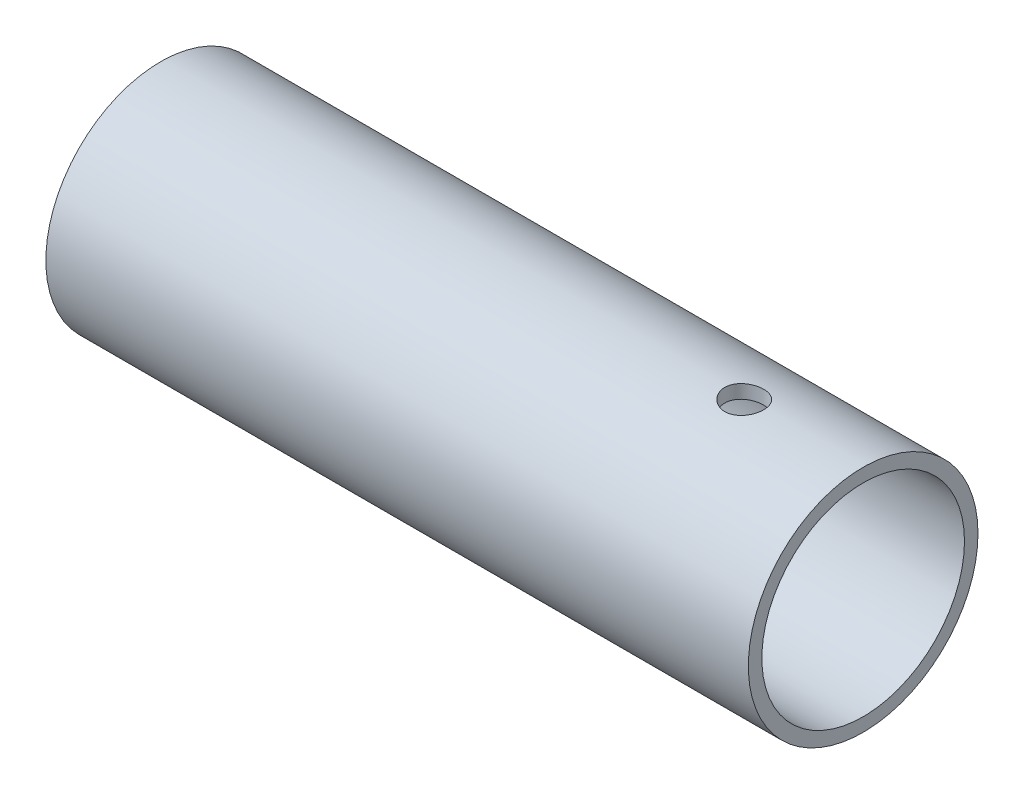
ISO-10303-21;
HEADER;
FILE_DESCRIPTION(('STEP AP214'),'2;1');
FILE_NAME('part.step','',(''),(''),'','','');
FILE_SCHEMA(('AUTOMOTIVE_DESIGN { 1 0 10303 214 1 1 1 1 }'));
ENDSEC;
DATA;
#1=APPLICATION_CONTEXT('core data for automotive mechanical design processes');
#2=APPLICATION_PROTOCOL_DEFINITION('international standard','automotive_design',2000,#1);
#3=PRODUCT_CONTEXT('',#1,'mechanical');
#4=PRODUCT('Part','Part','',(#3));
#5=PRODUCT_RELATED_PRODUCT_CATEGORY('part','',(#4));
#6=PRODUCT_DEFINITION_FORMATION('','',#4);
#7=PRODUCT_DEFINITION_CONTEXT('part definition',#1,'design');
#8=PRODUCT_DEFINITION('design','',#6,#7);
#9=PRODUCT_DEFINITION_SHAPE('','',#8);
#10=(LENGTH_UNIT() NAMED_UNIT(*) SI_UNIT(.MILLI.,.METRE.));
#11=(NAMED_UNIT(*) PLANE_ANGLE_UNIT() SI_UNIT($,.RADIAN.));
#12=(NAMED_UNIT(*) SI_UNIT($,.STERADIAN.) SOLID_ANGLE_UNIT());
#13=UNCERTAINTY_MEASURE_WITH_UNIT(LENGTH_MEASURE(1.E-05),#10,'distance_accuracy_value','');
#14=(GEOMETRIC_REPRESENTATION_CONTEXT(3) GLOBAL_UNCERTAINTY_ASSIGNED_CONTEXT((#13)) GLOBAL_UNIT_ASSIGNED_CONTEXT((#10,
#11,#12)) REPRESENTATION_CONTEXT('',''));
#15=CARTESIAN_POINT('',(0.,0.,0.));
#16=DIRECTION('',(0.,0.,1.));
#17=DIRECTION('',(1.,0.,0.));
#18=AXIS2_PLACEMENT_3D('',#15,#16,#17);
#19=CARTESIAN_POINT('',(330.2,0.,0.));
#20=DIRECTION('',(-1.,0.,0.));
#21=DIRECTION('',(0.,0.,1.));
#22=AXIS2_PLACEMENT_3D('',#19,#20,#21);
#23=CYLINDRICAL_SURFACE('',#22,53.975);
#24=CARTESIAN_POINT('',(55.88,-53.197537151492,9.12812499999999));
#25=CARTESIAN_POINT('',(56.1344780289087,-53.1975352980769,9.12812900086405));
#26=CARTESIAN_POINT('',(56.3889022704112,-53.19936669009,9.11748003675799));
#27=CARTESIAN_POINT('',(56.8959992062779,-53.2066348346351,9.07497278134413));
#28=CARTESIAN_POINT('',(57.1486715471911,-53.212072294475,9.04311032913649));
#29=CARTESIAN_POINT('',(57.650569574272,-53.2264020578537,8.95838065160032));
#30=CARTESIAN_POINT('',(57.8997923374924,-53.2352971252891,8.90549662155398));
#31=CARTESIAN_POINT('',(58.3928271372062,-53.2562822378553,8.77913017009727));
#32=CARTESIAN_POINT('',(58.636639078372,-53.2683723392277,8.70564738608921));
#33=CARTESIAN_POINT('',(59.1169230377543,-53.2953861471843,8.5387104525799));
#34=CARTESIAN_POINT('',(59.3534012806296,-53.3103073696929,8.44527380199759));
#35=CARTESIAN_POINT('',(59.8176081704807,-53.3425636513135,8.23907823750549));
#36=CARTESIAN_POINT('',(60.0453367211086,-53.3598987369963,8.12631911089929));
#37=CARTESIAN_POINT('',(60.4904189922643,-53.3964861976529,7.88232779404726));
#38=CARTESIAN_POINT('',(60.7077758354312,-53.4157379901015,7.75110121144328));
#39=CARTESIAN_POINT('',(61.1307954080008,-53.4556306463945,7.471023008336));
#40=CARTESIAN_POINT('',(61.3364539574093,-53.4762720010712,7.32216514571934));
#41=CARTESIAN_POINT('',(61.7363429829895,-53.5185465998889,7.00652266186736));
#42=CARTESIAN_POINT('',(61.9304587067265,-53.5401869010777,6.83959358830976));
#43=CARTESIAN_POINT('',(62.3040609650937,-53.5836922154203,6.48996090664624));
#44=CARTESIAN_POINT('',(62.4835408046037,-53.6055573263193,6.30725015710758));
#45=CARTESIAN_POINT('',(62.8265508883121,-53.6488916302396,5.92735973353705));
#46=CARTESIAN_POINT('',(62.9900801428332,-53.6703607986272,5.73017916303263));
#47=CARTESIAN_POINT('',(63.299968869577,-53.7122921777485,5.32279961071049));
#48=CARTESIAN_POINT('',(63.446336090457,-53.7327548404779,5.11260657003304));
#49=CARTESIAN_POINT('',(63.7218593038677,-53.7722418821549,4.67913390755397));
#50=CARTESIAN_POINT('',(63.8508954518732,-53.7912558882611,4.45577713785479));
#51=CARTESIAN_POINT('',(64.0896220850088,-53.8271485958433,3.9988970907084));
#52=CARTESIAN_POINT('',(64.1993199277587,-53.8440281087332,3.76537772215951));
#53=CARTESIAN_POINT('',(64.3986259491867,-53.8751821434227,3.2897085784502));
#54=CARTESIAN_POINT('',(64.4882312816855,-53.8894562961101,3.04755758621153));
#55=CARTESIAN_POINT('',(64.6466475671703,-53.9149881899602,2.55639182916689));
#56=CARTESIAN_POINT('',(64.7154587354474,-53.9262459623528,2.30737713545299));
#57=CARTESIAN_POINT('',(64.831199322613,-53.9453306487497,1.80667988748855));
#58=CARTESIAN_POINT('',(64.8783303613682,-53.9531891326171,1.55504513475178));
#59=CARTESIAN_POINT('',(64.9513009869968,-53.9654071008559,1.04862285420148));
#60=CARTESIAN_POINT('',(64.9771406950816,-53.9697666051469,0.793835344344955));
#61=CARTESIAN_POINT('',(65.0073251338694,-53.9748626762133,0.282969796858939));
#62=CARTESIAN_POINT('',(65.0116711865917,-53.9755994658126,0.0268918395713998));
#63=CARTESIAN_POINT('',(64.998837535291,-53.9734297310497,-0.484707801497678));
#64=CARTESIAN_POINT('',(64.9816579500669,-53.9705232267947,-0.740229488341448));
#65=CARTESIAN_POINT('',(64.9261989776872,-53.9611984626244,-1.24621457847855));
#66=CARTESIAN_POINT('',(64.8881408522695,-53.9548170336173,-1.49670295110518));
#67=CARTESIAN_POINT('',(64.7913506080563,-53.9387416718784,-1.99363942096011));
#68=CARTESIAN_POINT('',(64.7326109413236,-53.9290465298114,-2.24008600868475));
#69=CARTESIAN_POINT('',(64.5949155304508,-53.9066146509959,-2.72707391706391));
#70=CARTESIAN_POINT('',(64.515963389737,-53.8938784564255,-2.96761628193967));
#71=CARTESIAN_POINT('',(64.3384198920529,-53.8657140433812,-3.44118425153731));
#72=CARTESIAN_POINT('',(64.2398279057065,-53.8502857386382,-3.67420961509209));
#73=CARTESIAN_POINT('',(64.0232159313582,-53.8170830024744,-4.13221143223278));
#74=CARTESIAN_POINT('',(63.9051074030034,-53.7992979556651,-4.35714523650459));
#75=CARTESIAN_POINT('',(63.6506324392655,-53.7619275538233,-4.79628400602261));
#76=CARTESIAN_POINT('',(63.514265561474,-53.7423421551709,-5.01048871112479));
#77=CARTESIAN_POINT('',(63.2242225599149,-53.7019082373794,-5.42673111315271));
#78=CARTESIAN_POINT('',(63.0705454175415,-53.6810596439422,-5.62876809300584));
#79=CARTESIAN_POINT('',(62.7469447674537,-53.6386723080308,-6.01930615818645));
#80=CARTESIAN_POINT('',(62.577021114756,-53.6171335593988,-6.20780712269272));
#81=CARTESIAN_POINT('',(62.2198569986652,-53.5736870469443,-6.57227437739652));
#82=CARTESIAN_POINT('',(62.0324264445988,-53.5517780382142,-6.74805429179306));
#83=CARTESIAN_POINT('',(61.6433865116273,-53.5084780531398,-7.08321700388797));
#84=CARTESIAN_POINT('',(61.4417773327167,-53.4870870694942,-7.24260003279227));
#85=CARTESIAN_POINT('',(61.0257553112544,-53.4454294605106,-7.54386028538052));
#86=CARTESIAN_POINT('',(60.8113419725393,-53.4251628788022,-7.68573683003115));
#87=CARTESIAN_POINT('',(60.3712052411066,-53.3863357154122,-7.95095937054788));
#88=CARTESIAN_POINT('',(60.1454821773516,-53.3677750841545,-8.07430590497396));
#89=CARTESIAN_POINT('',(59.6839684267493,-53.3328709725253,-8.3017324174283));
#90=CARTESIAN_POINT('',(59.448164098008,-53.3165306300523,-8.40578520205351));
#91=CARTESIAN_POINT('',(58.9685411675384,-53.2865817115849,-8.59359534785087));
#92=CARTESIAN_POINT('',(58.7247256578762,-53.2729720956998,-8.67736043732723));
#93=CARTESIAN_POINT('',(58.230711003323,-53.2488772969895,-8.82401385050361));
#94=CARTESIAN_POINT('',(57.9805111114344,-53.2383924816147,-8.88689971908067));
#95=CARTESIAN_POINT('',(57.4755717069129,-53.2208619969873,-8.9912891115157));
#96=CARTESIAN_POINT('',(57.2208322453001,-53.2138162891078,-9.03279287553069));
#97=CARTESIAN_POINT('',(56.7118324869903,-53.203439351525,-9.09371263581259));
#98=CARTESIAN_POINT('',(56.4576048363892,-53.200063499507,-9.11339403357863));
#99=CARTESIAN_POINT('',(55.948372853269,-53.1969718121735,-9.13142377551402));
#100=CARTESIAN_POINT('',(55.6933685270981,-53.1972559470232,-9.12977229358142));
#101=CARTESIAN_POINT('',(55.1844319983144,-53.2014757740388,-9.10514992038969));
#102=CARTESIAN_POINT('',(54.9304997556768,-53.2054113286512,-9.08217983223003));
#103=CARTESIAN_POINT('',(54.4255241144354,-53.2168181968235,-9.01510070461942));
#104=CARTESIAN_POINT('',(54.1744807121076,-53.2242895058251,-8.97099169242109));
#105=CARTESIAN_POINT('',(53.6787532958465,-53.242487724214,-8.8623435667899));
#106=CARTESIAN_POINT('',(53.4340378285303,-53.2531923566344,-8.7979441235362));
#107=CARTESIAN_POINT('',(52.9508421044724,-53.2775719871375,-8.64908279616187));
#108=CARTESIAN_POINT('',(52.7123641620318,-53.2912480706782,-8.56461357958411));
#109=CARTESIAN_POINT('',(52.2434132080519,-53.3211774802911,-8.37626061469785));
#110=CARTESIAN_POINT('',(52.0129390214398,-53.3374304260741,-8.27237973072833));
#111=CARTESIAN_POINT('',(51.5615178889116,-53.3720581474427,-8.04593967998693));
#112=CARTESIAN_POINT('',(51.3405712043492,-53.390432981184,-7.92338000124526));
#113=CARTESIAN_POINT('',(50.9076543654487,-53.4289738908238,-7.65920055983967));
#114=CARTESIAN_POINT('',(50.6957889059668,-53.4491552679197,-7.51741145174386));
#115=CARTESIAN_POINT('',(50.2847149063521,-53.4905911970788,-7.21666897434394));
#116=CARTESIAN_POINT('',(50.0855068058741,-53.5118457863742,-7.05771500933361));
#117=CARTESIAN_POINT('',(49.7011334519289,-53.55483054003,-6.72376969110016));
#118=CARTESIAN_POINT('',(49.5159658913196,-53.5765606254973,-6.5487809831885));
#119=CARTESIAN_POINT('',(49.1608160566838,-53.6199058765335,-6.18385697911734));
#120=CARTESIAN_POINT('',(48.9908404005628,-53.6415209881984,-5.99391523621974));
#121=CARTESIAN_POINT('',(48.6655858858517,-53.6842570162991,-5.59831837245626));
#122=CARTESIAN_POINT('',(48.5104847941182,-53.7053701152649,-5.39251619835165));
#123=CARTESIAN_POINT('',(48.2182432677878,-53.7462514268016,-4.96854204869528));
#124=CARTESIAN_POINT('',(48.0810948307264,-53.7660202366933,-4.75037564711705));
#125=CARTESIAN_POINT('',(47.8256169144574,-53.8036715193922,-4.30301684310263));
#126=CARTESIAN_POINT('',(47.7072948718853,-53.8215532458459,-4.07382012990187));
#127=CARTESIAN_POINT('',(47.4904512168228,-53.8549069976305,-3.60618048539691));
#128=CARTESIAN_POINT('',(47.391922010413,-53.8703799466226,-3.36774114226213));
#129=CARTESIAN_POINT('',(47.2157315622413,-53.8984226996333,-2.88427271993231));
#130=CARTESIAN_POINT('',(47.137982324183,-53.9110047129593,-2.63927642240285));
#131=CARTESIAN_POINT('',(47.0033900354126,-53.9329931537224,-2.14346590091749));
#132=CARTESIAN_POINT('',(46.9465469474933,-53.9423995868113,-1.89265168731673));
#133=CARTESIAN_POINT('',(46.8542128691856,-53.9577679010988,-1.38703672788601));
#134=CARTESIAN_POINT('',(46.8187203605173,-53.9637300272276,-1.13223626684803));
#135=CARTESIAN_POINT('',(46.7693614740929,-53.9720399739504,-0.620491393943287));
#136=CARTESIAN_POINT('',(46.755494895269,-53.9743878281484,-0.363547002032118));
#137=CARTESIAN_POINT('',(46.7495345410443,-53.9753958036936,0.147389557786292));
#138=CARTESIAN_POINT('',(46.7571710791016,-53.9741016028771,0.40137853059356));
#139=CARTESIAN_POINT('',(46.793580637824,-53.9679595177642,0.907797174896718));
#140=CARTESIAN_POINT('',(46.8223539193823,-53.9631115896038,1.16022682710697));
#141=CARTESIAN_POINT('',(46.9008145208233,-53.9499975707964,1.66171777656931));
#142=CARTESIAN_POINT('',(46.9505014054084,-53.9417315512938,1.91077914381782));
#143=CARTESIAN_POINT('',(47.0704103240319,-53.9220116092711,2.40377893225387));
#144=CARTESIAN_POINT('',(47.1406324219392,-53.9105576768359,2.64771733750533));
#145=CARTESIAN_POINT('',(47.3009751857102,-53.8847972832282,3.12843615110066));
#146=CARTESIAN_POINT('',(47.3910685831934,-53.8704947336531,3.36522586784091));
#147=CARTESIAN_POINT('',(47.5905823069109,-53.8394158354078,3.83044402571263));
#148=CARTESIAN_POINT('',(47.7000092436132,-53.8226386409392,4.05886957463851));
#149=CARTESIAN_POINT('',(47.9373657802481,-53.7870768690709,4.50568691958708));
#150=CARTESIAN_POINT('',(48.0652926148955,-53.7682925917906,4.72408020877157));
#151=CARTESIAN_POINT('',(48.3387667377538,-53.7292271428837,5.14940706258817));
#152=CARTESIAN_POINT('',(48.4843146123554,-53.7089459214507,5.35634024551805));
#153=CARTESIAN_POINT('',(48.793839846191,-53.6671952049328,5.75972122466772));
#154=CARTESIAN_POINT('',(48.9580140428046,-53.6457145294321,5.95601685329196));
#155=CARTESIAN_POINT('',(49.3022346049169,-53.602386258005,6.33411648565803));
#156=CARTESIAN_POINT('',(49.4822810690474,-53.5805386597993,6.51592039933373));
#157=CARTESIAN_POINT('',(49.8570575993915,-53.5370820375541,6.86383431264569));
#158=CARTESIAN_POINT('',(50.0517912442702,-53.5154730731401,7.02994046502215));
#159=CARTESIAN_POINT('',(50.4545691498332,-53.4731068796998,7.34525552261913));
#160=CARTESIAN_POINT('',(50.6626131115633,-53.452349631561,7.49446480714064));
#161=CARTESIAN_POINT('',(51.0922082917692,-53.4121226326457,7.77599913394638));
#162=CARTESIAN_POINT('',(51.3138493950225,-53.3926637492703,7.90818863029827));
#163=CARTESIAN_POINT('',(51.7675728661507,-53.3557767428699,8.15334779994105));
#164=CARTESIAN_POINT('',(51.9996513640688,-53.338347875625,8.26632452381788));
#165=CARTESIAN_POINT('',(52.4725351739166,-53.3060334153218,8.47220704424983));
#166=CARTESIAN_POINT('',(52.713334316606,-53.2911460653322,8.56512671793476));
#167=CARTESIAN_POINT('',(53.2020049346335,-53.2643413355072,8.73026587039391));
#168=CARTESIAN_POINT('',(53.4498748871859,-53.2524233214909,8.80248976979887));
#169=CARTESIAN_POINT('',(54.056415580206,-53.227598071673,8.95161754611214));
#170=CARTESIAN_POINT('',(54.4178662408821,-53.2163806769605,9.01772824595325));
#171=CARTESIAN_POINT('',(55.1462485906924,-53.2013516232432,9.10597867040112));
#172=CARTESIAN_POINT('',(55.5131801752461,-53.1975398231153,9.12811923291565));
#173=CARTESIAN_POINT('',(55.88,-53.197537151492,9.12812499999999));
#174=B_SPLINE_CURVE_WITH_KNOTS('',3,(#24,#25,#26,#27,#28,#29,#30,#31,#32,#33,#34,#35,#36,#37,
#38,#39,#40,#41,#42,#43,#44,#45,#46,#47,#48,#49,#50,#51,#52,#53,#54,#55,#56,#57,#58,#59,#60,#61,
#62,#63,#64,#65,#66,#67,#68,#69,#70,#71,#72,#73,#74,#75,#76,#77,#78,#79,#80,#81,#82,#83,#84,#85,
#86,#87,#88,#89,#90,#91,#92,#93,#94,#95,#96,#97,#98,#99,#100,#101,#102,#103,#104,#105,#106,#107,
#108,#109,#110,#111,#112,#113,#114,#115,#116,#117,#118,#119,#120,#121,#122,#123,#124,#125,#126,
#127,#128,#129,#130,#131,#132,#133,#134,#135,#136,#137,#138,#139,#140,#141,#142,#143,#144,#145,
#146,#147,#148,#149,#150,#151,#152,#153,#154,#155,#156,#157,#158,#159,#160,#161,#162,#163,#164,
#165,#166,#167,#168,#169,#170,#171,#172,#173),.UNSPECIFIED.,.T.,.F.,(4,2,2,2,2,2,2,2,2,2,2,2,2,
2,2,2,2,2,2,2,2,2,2,2,2,2,2,2,2,2,2,2,2,2,2,2,2,2,2,2,2,2,2,2,2,2,2,2,2,2,2,2,2,2,2,2,2,2,2,2,2,
2,2,2,2,2,2,2,2,2,2,2,2,2,4),(0.,0.763112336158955,1.52637439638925,2.29024784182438,
3.05413473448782,3.81735445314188,4.58058257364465,5.34357943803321,6.10684724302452,
6.87674336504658,7.64698971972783,8.41728383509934,9.18722881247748,9.96225038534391,
10.7369764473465,11.5118121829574,12.2866398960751,13.0541084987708,13.8215727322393,
14.5889897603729,15.3564025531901,16.1158354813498,16.8755458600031,17.6351208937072,
18.3947202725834,19.1578654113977,19.9210290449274,20.6842376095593,21.4474529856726,
22.2202191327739,22.9929743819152,23.7657595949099,24.5385223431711,25.3123661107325,
26.0859146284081,26.8595540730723,27.6331848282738,28.3972998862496,29.161408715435,
29.9254887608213,30.6895678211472,31.4484981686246,32.2077062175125,32.9668023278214,
33.725919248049,34.4922176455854,35.2585426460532,36.0247414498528,36.7912724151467,
37.5660491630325,38.3404793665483,39.1152147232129,39.8896522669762,40.660756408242,
41.4318591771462,42.2029071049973,42.9739478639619,43.7353616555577,44.496784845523,
45.258192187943,46.0196018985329,46.7799731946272,47.5406049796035,48.3011231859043,
49.0616667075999,49.8311661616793,50.6006703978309,51.3703627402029,52.1400378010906,
52.9155063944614,53.6906897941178,54.46533512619,55.2398148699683,56.3398315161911,
57.4398271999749),.UNSPECIFIED.);
#175=CARTESIAN_POINT('',(55.88,-53.197537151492,9.12812499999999));
#176=VERTEX_POINT('',#175);
#177=EDGE_CURVE('E72',#176,#176,#174,.T.);
#178=ORIENTED_EDGE('',*,*,#177,.T.);
#179=EDGE_LOOP('',(#178));
#180=FACE_BOUND('',#179,.T.);
#181=CARTESIAN_POINT('',(330.2,0.,0.));
#182=DIRECTION('',(1.,0.,0.));
#183=DIRECTION('',(0.,0.,-1.));
#184=AXIS2_PLACEMENT_3D('',#181,#182,#183);
#185=CIRCLE('',#184,53.975);
#186=CARTESIAN_POINT('',(330.2,0.,-53.975));
#187=VERTEX_POINT('',#186);
#188=EDGE_CURVE('E10',#187,#187,#185,.T.);
#189=ORIENTED_EDGE('',*,*,#188,.F.);
#190=EDGE_LOOP('',(#189));
#191=FACE_BOUND('',#190,.T.);
#192=CARTESIAN_POINT('',(0.,0.,0.));
#193=DIRECTION('',(1.,0.,0.));
#194=DIRECTION('',(0.,0.,-1.));
#195=AXIS2_PLACEMENT_3D('',#192,#193,#194);
#196=CIRCLE('',#195,53.975);
#197=CARTESIAN_POINT('',(0.,0.,-53.975));
#198=VERTEX_POINT('',#197);
#199=EDGE_CURVE('E54',#198,#198,#196,.T.);
#200=ORIENTED_EDGE('',*,*,#199,.T.);
#201=EDGE_LOOP('',(#200));
#202=FACE_BOUND('',#201,.T.);
#203=CARTESIAN_POINT('',(274.32,53.197537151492,-9.12812500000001));
#204=CARTESIAN_POINT('',(274.065521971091,53.1975352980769,-9.12812900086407));
#205=CARTESIAN_POINT('',(273.811097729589,53.19936669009,-9.11748003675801));
#206=CARTESIAN_POINT('',(273.304000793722,53.206634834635,-9.07497278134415));
#207=CARTESIAN_POINT('',(273.051328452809,53.212072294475,-9.04311032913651));
#208=CARTESIAN_POINT('',(272.549430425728,53.2264020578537,-8.95838065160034));
#209=CARTESIAN_POINT('',(272.300207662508,53.2352971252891,-8.905496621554));
#210=CARTESIAN_POINT('',(271.807172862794,53.2562822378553,-8.77913017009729));
#211=CARTESIAN_POINT('',(271.563360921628,53.2683723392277,-8.70564738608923));
#212=CARTESIAN_POINT('',(271.083076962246,53.2953861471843,-8.53871045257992));
#213=CARTESIAN_POINT('',(270.84659871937,53.3103073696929,-8.4452738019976));
#214=CARTESIAN_POINT('',(270.382391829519,53.3425636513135,-8.23907823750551));
#215=CARTESIAN_POINT('',(270.154663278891,53.3598987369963,-8.12631911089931));
#216=CARTESIAN_POINT('',(269.709581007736,53.3964861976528,-7.88232779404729));
#217=CARTESIAN_POINT('',(269.492224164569,53.4157379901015,-7.7511012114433));
#218=CARTESIAN_POINT('',(269.069204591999,53.4556306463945,-7.47102300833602));
#219=CARTESIAN_POINT('',(268.863546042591,53.4762720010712,-7.32216514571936));
#220=CARTESIAN_POINT('',(268.463657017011,53.5185465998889,-7.00652266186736));
#221=CARTESIAN_POINT('',(268.269541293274,53.5401869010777,-6.83959358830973));
#222=CARTESIAN_POINT('',(267.895939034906,53.5836922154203,-6.4899609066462));
#223=CARTESIAN_POINT('',(267.716459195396,53.6055573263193,-6.30725015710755));
#224=CARTESIAN_POINT('',(267.373449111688,53.6488916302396,-5.92735973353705));
#225=CARTESIAN_POINT('',(267.209919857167,53.6703607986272,-5.73017916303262));
#226=CARTESIAN_POINT('',(266.900031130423,53.7122921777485,-5.32279961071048));
#227=CARTESIAN_POINT('',(266.753663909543,53.7327548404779,-5.11260657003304));
#228=CARTESIAN_POINT('',(266.478140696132,53.7722418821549,-4.67913390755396));
#229=CARTESIAN_POINT('',(266.349104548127,53.7912558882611,-4.45577713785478));
#230=CARTESIAN_POINT('',(266.110377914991,53.8271485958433,-3.99889709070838));
#231=CARTESIAN_POINT('',(266.000680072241,53.8440281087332,-3.76537772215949));
#232=CARTESIAN_POINT('',(265.801374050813,53.8751821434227,-3.28970857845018));
#233=CARTESIAN_POINT('',(265.711768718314,53.8894562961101,-3.04755758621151));
#234=CARTESIAN_POINT('',(265.55335243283,53.9149881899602,-2.55639182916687));
#235=CARTESIAN_POINT('',(265.484541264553,53.9262459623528,-2.30737713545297));
#236=CARTESIAN_POINT('',(265.368800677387,53.9453306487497,-1.80667988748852));
#237=CARTESIAN_POINT('',(265.321669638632,53.9531891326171,-1.55504513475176));
#238=CARTESIAN_POINT('',(265.248699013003,53.9654071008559,-1.04862285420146));
#239=CARTESIAN_POINT('',(265.222859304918,53.9697666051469,-0.79383534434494));
#240=CARTESIAN_POINT('',(265.192674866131,53.9748626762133,-0.282969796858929));
#241=CARTESIAN_POINT('',(265.188328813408,53.9755994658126,-0.0268918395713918));
#242=CARTESIAN_POINT('',(265.201162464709,53.9734297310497,0.484707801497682));
#243=CARTESIAN_POINT('',(265.218342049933,53.9705232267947,0.74022948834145));
#244=CARTESIAN_POINT('',(265.273801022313,53.9611984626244,1.24621457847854));
#245=CARTESIAN_POINT('',(265.311859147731,53.9548170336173,1.49670295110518));
#246=CARTESIAN_POINT('',(265.408649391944,53.9387416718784,1.9936394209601));
#247=CARTESIAN_POINT('',(265.467389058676,53.9290465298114,2.24008600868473));
#248=CARTESIAN_POINT('',(265.605084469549,53.9066146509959,2.72707391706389));
#249=CARTESIAN_POINT('',(265.684036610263,53.8938784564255,2.96761628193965));
#250=CARTESIAN_POINT('',(265.861580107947,53.8657140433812,3.4411842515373));
#251=CARTESIAN_POINT('',(265.960172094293,53.8502857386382,3.67420961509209));
#252=CARTESIAN_POINT('',(266.176784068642,53.8170830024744,4.13221143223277));
#253=CARTESIAN_POINT('',(266.294892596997,53.7992979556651,4.35714523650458));
#254=CARTESIAN_POINT('',(266.549367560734,53.7619275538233,4.7962840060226));
#255=CARTESIAN_POINT('',(266.685734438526,53.7423421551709,5.01048871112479));
#256=CARTESIAN_POINT('',(266.975777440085,53.7019082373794,5.42673111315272));
#257=CARTESIAN_POINT('',(267.129454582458,53.6810596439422,5.62876809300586));
#258=CARTESIAN_POINT('',(267.453055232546,53.6386723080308,6.01930615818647));
#259=CARTESIAN_POINT('',(267.622978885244,53.6171335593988,6.20780712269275));
#260=CARTESIAN_POINT('',(267.980143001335,53.5736870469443,6.57227437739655));
#261=CARTESIAN_POINT('',(268.167573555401,53.5517780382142,6.74805429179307));
#262=CARTESIAN_POINT('',(268.556613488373,53.5084780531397,7.08321700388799));
#263=CARTESIAN_POINT('',(268.758222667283,53.4870870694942,7.2426000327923));
#264=CARTESIAN_POINT('',(269.174244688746,53.4454294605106,7.54386028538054));
#265=CARTESIAN_POINT('',(269.388658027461,53.4251628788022,7.68573683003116));
#266=CARTESIAN_POINT('',(269.828794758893,53.3863357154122,7.95095937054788));
#267=CARTESIAN_POINT('',(270.054517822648,53.3677750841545,8.07430590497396));
#268=CARTESIAN_POINT('',(270.516031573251,53.3328709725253,8.3017324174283));
#269=CARTESIAN_POINT('',(270.751835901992,53.3165306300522,8.40578520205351));
#270=CARTESIAN_POINT('',(271.231458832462,53.2865817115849,8.59359534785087));
#271=CARTESIAN_POINT('',(271.475274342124,53.2729720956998,8.67736043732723));
#272=CARTESIAN_POINT('',(271.969288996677,53.2488772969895,8.82401385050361));
#273=CARTESIAN_POINT('',(272.219488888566,53.2383924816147,8.88689971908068));
#274=CARTESIAN_POINT('',(272.724428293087,53.2208619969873,8.99128911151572));
#275=CARTESIAN_POINT('',(272.9791677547,53.2138162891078,9.03279287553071));
#276=CARTESIAN_POINT('',(273.48816751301,53.203439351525,9.09371263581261));
#277=CARTESIAN_POINT('',(273.742395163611,53.200063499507,9.11339403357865));
#278=CARTESIAN_POINT('',(274.251627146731,53.1969718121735,9.13142377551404));
#279=CARTESIAN_POINT('',(274.506631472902,53.1972559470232,9.12977229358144));
#280=CARTESIAN_POINT('',(275.015568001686,53.2014757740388,9.10514992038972));
#281=CARTESIAN_POINT('',(275.269500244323,53.2054113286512,9.08217983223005));
#282=CARTESIAN_POINT('',(275.774475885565,53.2168181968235,9.01510070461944));
#283=CARTESIAN_POINT('',(276.025519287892,53.2242895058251,8.9709916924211));
#284=CARTESIAN_POINT('',(276.521246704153,53.242487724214,8.86234356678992));
#285=CARTESIAN_POINT('',(276.76596217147,53.2531923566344,8.79794412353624));
#286=CARTESIAN_POINT('',(277.249157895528,53.2775719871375,8.64908279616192));
#287=CARTESIAN_POINT('',(277.487635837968,53.2912480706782,8.56461357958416));
#288=CARTESIAN_POINT('',(277.956586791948,53.3211774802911,8.3762606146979));
#289=CARTESIAN_POINT('',(278.18706097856,53.3374304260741,8.27237973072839));
#290=CARTESIAN_POINT('',(278.638482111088,53.3720581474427,8.04593967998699));
#291=CARTESIAN_POINT('',(278.859428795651,53.390432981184,7.92338000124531));
#292=CARTESIAN_POINT('',(279.292345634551,53.4289738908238,7.65920055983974));
#293=CARTESIAN_POINT('',(279.504211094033,53.4491552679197,7.51741145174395));
#294=CARTESIAN_POINT('',(279.915285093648,53.4905911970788,7.21666897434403));
#295=CARTESIAN_POINT('',(280.114493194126,53.5118457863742,7.05771500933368));
#296=CARTESIAN_POINT('',(280.498866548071,53.55483054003,6.72376969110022));
#297=CARTESIAN_POINT('',(280.68403410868,53.5765606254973,6.54878098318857));
#298=CARTESIAN_POINT('',(281.039183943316,53.6199058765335,6.1838569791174));
#299=CARTESIAN_POINT('',(281.209159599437,53.6415209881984,5.99391523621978));
#300=CARTESIAN_POINT('',(281.534414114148,53.6842570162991,5.59831837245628));
#301=CARTESIAN_POINT('',(281.689515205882,53.7053701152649,5.39251619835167));
#302=CARTESIAN_POINT('',(281.981756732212,53.7462514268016,4.9685420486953));
#303=CARTESIAN_POINT('',(282.118905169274,53.7660202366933,4.75037564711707));
#304=CARTESIAN_POINT('',(282.374383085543,53.8036715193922,4.30301684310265));
#305=CARTESIAN_POINT('',(282.492705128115,53.8215532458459,4.07382012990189));
#306=CARTESIAN_POINT('',(282.709548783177,53.8549069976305,3.60618048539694));
#307=CARTESIAN_POINT('',(282.808077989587,53.8703799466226,3.36774114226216));
#308=CARTESIAN_POINT('',(282.984268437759,53.8984226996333,2.88427271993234));
#309=CARTESIAN_POINT('',(283.062017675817,53.9110047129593,2.63927642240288));
#310=CARTESIAN_POINT('',(283.196609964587,53.9329931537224,2.14346590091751));
#311=CARTESIAN_POINT('',(283.253453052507,53.9423995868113,1.89265168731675));
#312=CARTESIAN_POINT('',(283.345787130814,53.9577679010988,1.38703672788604));
#313=CARTESIAN_POINT('',(283.381279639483,53.9637300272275,1.13223626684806));
#314=CARTESIAN_POINT('',(283.430638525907,53.9720399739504,0.620491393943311));
#315=CARTESIAN_POINT('',(283.444505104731,53.9743878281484,0.363547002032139));
#316=CARTESIAN_POINT('',(283.450465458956,53.9753958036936,-0.147389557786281));
#317=CARTESIAN_POINT('',(283.442828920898,53.9741016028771,-0.401378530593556));
#318=CARTESIAN_POINT('',(283.406419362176,53.9679595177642,-0.907797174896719));
#319=CARTESIAN_POINT('',(283.377646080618,53.9631115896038,-1.16022682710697));
#320=CARTESIAN_POINT('',(283.299185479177,53.9499975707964,-1.66171777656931));
#321=CARTESIAN_POINT('',(283.249498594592,53.9417315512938,-1.91077914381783));
#322=CARTESIAN_POINT('',(283.129589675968,53.9220116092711,-2.40377893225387));
#323=CARTESIAN_POINT('',(283.059367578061,53.9105576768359,-2.64771733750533));
#324=CARTESIAN_POINT('',(282.89902481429,53.8847972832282,-3.12843615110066));
#325=CARTESIAN_POINT('',(282.808931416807,53.8704947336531,-3.36522586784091));
#326=CARTESIAN_POINT('',(282.609417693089,53.8394158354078,-3.83044402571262));
#327=CARTESIAN_POINT('',(282.499990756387,53.8226386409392,-4.0588695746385));
#328=CARTESIAN_POINT('',(282.262634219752,53.7870768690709,-4.50568691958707));
#329=CARTESIAN_POINT('',(282.134707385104,53.7682925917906,-4.72408020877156));
#330=CARTESIAN_POINT('',(281.861233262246,53.7292271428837,-5.14940706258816));
#331=CARTESIAN_POINT('',(281.715685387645,53.7089459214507,-5.35634024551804));
#332=CARTESIAN_POINT('',(281.406160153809,53.6671952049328,-5.75972122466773));
#333=CARTESIAN_POINT('',(281.241985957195,53.6457145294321,-5.95601685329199));
#334=CARTESIAN_POINT('',(280.897765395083,53.602386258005,-6.33411648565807));
#335=CARTESIAN_POINT('',(280.717718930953,53.5805386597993,-6.51592039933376));
#336=CARTESIAN_POINT('',(280.342942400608,53.5370820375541,-6.86383431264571));
#337=CARTESIAN_POINT('',(280.14820875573,53.5154730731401,-7.02994046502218));
#338=CARTESIAN_POINT('',(279.745430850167,53.4731068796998,-7.34525552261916));
#339=CARTESIAN_POINT('',(279.537386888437,53.452349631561,-7.49446480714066));
#340=CARTESIAN_POINT('',(279.107791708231,53.4121226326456,-7.77599913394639));
#341=CARTESIAN_POINT('',(278.886150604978,53.3926637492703,-7.90818863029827));
#342=CARTESIAN_POINT('',(278.432427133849,53.3557767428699,-8.15334779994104));
#343=CARTESIAN_POINT('',(278.200348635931,53.338347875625,-8.26632452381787));
#344=CARTESIAN_POINT('',(277.727464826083,53.3060334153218,-8.47220704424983));
#345=CARTESIAN_POINT('',(277.486665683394,53.2911460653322,-8.56512671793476));
#346=CARTESIAN_POINT('',(276.997995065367,53.2643413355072,-8.73026587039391));
#347=CARTESIAN_POINT('',(276.750125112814,53.2524233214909,-8.80248976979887));
#348=CARTESIAN_POINT('',(276.143584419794,53.227598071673,-8.95161754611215));
#349=CARTESIAN_POINT('',(275.782133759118,53.2163806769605,-9.01772824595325));
#350=CARTESIAN_POINT('',(275.053751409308,53.2013516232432,-9.10597867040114));
#351=CARTESIAN_POINT('',(274.686819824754,53.1975398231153,-9.12811923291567));
#352=CARTESIAN_POINT('',(274.32,53.197537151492,-9.12812500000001));
#353=B_SPLINE_CURVE_WITH_KNOTS('',3,(#203,#204,#205,#206,#207,#208,#209,#210,#211,#212,#213,
#214,#215,#216,#217,#218,#219,#220,#221,#222,#223,#224,#225,#226,#227,#228,#229,#230,#231,#232,
#233,#234,#235,#236,#237,#238,#239,#240,#241,#242,#243,#244,#245,#246,#247,#248,#249,#250,#251,
#252,#253,#254,#255,#256,#257,#258,#259,#260,#261,#262,#263,#264,#265,#266,#267,#268,#269,#270,
#271,#272,#273,#274,#275,#276,#277,#278,#279,#280,#281,#282,#283,#284,#285,#286,#287,#288,#289,
#290,#291,#292,#293,#294,#295,#296,#297,#298,#299,#300,#301,#302,#303,#304,#305,#306,#307,#308,
#309,#310,#311,#312,#313,#314,#315,#316,#317,#318,#319,#320,#321,#322,#323,#324,#325,#326,#327,
#328,#329,#330,#331,#332,#333,#334,#335,#336,#337,#338,#339,#340,#341,#342,#343,#344,#345,#346,
#347,#348,#349,#350,#351,#352),.UNSPECIFIED.,.T.,.F.,(4,2,2,2,2,2,2,2,2,2,2,2,2,2,2,2,2,2,2,2,2,
2,2,2,2,2,2,2,2,2,2,2,2,2,2,2,2,2,2,2,2,2,2,2,2,2,2,2,2,2,2,2,2,2,2,2,2,2,2,2,2,2,2,2,2,2,2,2,2,
2,2,2,2,2,4),(0.,0.76311233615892,1.52637439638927,2.29024784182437,3.05413473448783,
3.8173544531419,4.58058257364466,5.34357943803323,6.10684724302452,6.87674336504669,
7.6469897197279,8.4172838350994,9.18722881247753,9.96225038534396,10.7369764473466,
11.5118121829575,12.2866398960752,13.0541084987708,13.8215727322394,14.588989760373,
15.3564025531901,16.1158354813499,16.8755458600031,17.6351208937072,18.3947202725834,
19.1578654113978,19.9210290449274,20.6842376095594,21.4474529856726,22.220219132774,
22.9929743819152,23.7657595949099,24.5385223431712,25.3123661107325,26.0859146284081,
26.8595540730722,27.6331848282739,28.3972998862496,29.161408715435,29.9254887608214,
30.6895678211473,31.4484981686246,32.2077062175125,32.9668023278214,33.725919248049,
34.4922176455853,35.2585426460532,36.0247414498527,36.7912724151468,37.5660491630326,
38.3404793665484,39.1152147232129,39.8896522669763,40.6607564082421,41.4318591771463,
42.2029071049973,42.973947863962,43.7353616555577,44.4967848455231,45.2581921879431,
46.019601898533,46.7799731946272,47.5406049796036,48.3011231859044,49.0616667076,
49.8311661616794,50.600670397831,51.3703627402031,52.1400378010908,52.9155063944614,
53.6906897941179,54.46533512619,55.2398148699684,56.3398315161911,57.439827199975),.UNSPECIFIED.);
#354=CARTESIAN_POINT('',(274.32,53.197537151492,-9.12812500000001));
#355=VERTEX_POINT('',#354);
#356=EDGE_CURVE('E73',#355,#355,#353,.T.);
#357=ORIENTED_EDGE('',*,*,#356,.F.);
#358=EDGE_LOOP('',(#357));
#359=FACE_BOUND('',#358,.T.);
#360=ADVANCED_FACE('F40',(#180,#191,#202,#359),#23,.T.);
#361=CARTESIAN_POINT('',(330.2,0.,0.));
#362=DIRECTION('',(-1.,0.,0.));
#363=DIRECTION('',(0.,0.,1.));
#364=AXIS2_PLACEMENT_3D('',#361,#362,#363);
#365=CYLINDRICAL_SURFACE('',#364,47.625);
#366=CARTESIAN_POINT('',(0.,0.,0.));
#367=DIRECTION('',(1.,0.,0.));
#368=DIRECTION('',(0.,0.,-1.));
#369=AXIS2_PLACEMENT_3D('',#366,#367,#368);
#370=CIRCLE('',#369,47.625);
#371=CARTESIAN_POINT('',(0.,0.,-47.625));
#372=VERTEX_POINT('',#371);
#373=EDGE_CURVE('E63',#372,#372,#370,.T.);
#374=ORIENTED_EDGE('',*,*,#373,.F.);
#375=EDGE_LOOP('',(#374));
#376=FACE_BOUND('',#375,.T.);
#377=CARTESIAN_POINT('',(330.2,0.,0.));
#378=DIRECTION('',(1.,0.,0.));
#379=DIRECTION('',(0.,0.,-1.));
#380=AXIS2_PLACEMENT_3D('',#377,#378,#379);
#381=CIRCLE('',#380,47.625);
#382=CARTESIAN_POINT('',(330.2,0.,-47.625));
#383=VERTEX_POINT('',#382);
#384=EDGE_CURVE('E60',#383,#383,#381,.T.);
#385=ORIENTED_EDGE('',*,*,#384,.T.);
#386=EDGE_LOOP('',(#385));
#387=FACE_BOUND('',#386,.T.);
#388=CARTESIAN_POINT('',(55.88,-46.7420363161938,9.12812499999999));
#389=CARTESIAN_POINT('',(56.1339119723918,-46.7420338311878,9.12812975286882));
#390=CARTESIAN_POINT('',(56.3877633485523,-46.7441091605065,9.11752769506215));
#391=CARTESIAN_POINT('',(56.8937102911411,-46.7523438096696,9.07521212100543));
#392=CARTESIAN_POINT('',(57.1458055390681,-46.7585038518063,9.0434948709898));
#393=CARTESIAN_POINT('',(57.6465261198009,-46.7747355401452,8.959161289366));
#394=CARTESIAN_POINT('',(57.8951488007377,-46.7848100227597,8.9065298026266));
#395=CARTESIAN_POINT('',(58.3869866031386,-46.8085740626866,8.78078077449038));
#396=CARTESIAN_POINT('',(58.6302016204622,-46.8222636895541,8.70766283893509));
#397=CARTESIAN_POINT('',(59.1092793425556,-46.8528452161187,8.54158269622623));
#398=CARTESIAN_POINT('',(59.3451490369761,-46.8697339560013,8.44864005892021));
#399=CARTESIAN_POINT('',(59.8081707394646,-46.9062385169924,8.24355832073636));
#400=CARTESIAN_POINT('',(60.0353226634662,-46.9258543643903,8.13141903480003));
#401=CARTESIAN_POINT('',(60.4793140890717,-46.9672524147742,7.88878693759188));
#402=CARTESIAN_POINT('',(60.6961563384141,-46.989034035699,7.75829905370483));
#403=CARTESIAN_POINT('',(61.1182253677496,-47.0341675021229,7.47981344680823));
#404=CARTESIAN_POINT('',(61.3234479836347,-47.0575199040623,7.33180950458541));
#405=CARTESIAN_POINT('',(61.7230775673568,-47.1054106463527,7.01758118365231));
#406=CARTESIAN_POINT('',(61.9173368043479,-47.1299593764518,6.85117047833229));
#407=CARTESIAN_POINT('',(62.2912790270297,-47.1793183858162,6.50257910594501));
#408=CARTESIAN_POINT('',(62.4709553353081,-47.2041287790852,6.32039129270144));
#409=CARTESIAN_POINT('',(62.8144238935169,-47.25330988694,5.94153273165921));
#410=CARTESIAN_POINT('',(62.9782150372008,-47.2776805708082,5.74486097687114));
#411=CARTESIAN_POINT('',(63.2886972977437,-47.3252915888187,5.33846697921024));
#412=CARTESIAN_POINT('',(63.4353961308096,-47.3485324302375,5.1287506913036));
#413=CARTESIAN_POINT('',(63.7119071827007,-47.3934378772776,4.69578825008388));
#414=CARTESIAN_POINT('',(63.8415667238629,-47.4150875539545,4.47244299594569));
#415=CARTESIAN_POINT('',(64.0815323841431,-47.4559702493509,4.01548321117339));
#416=CARTESIAN_POINT('',(64.1918459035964,-47.4752041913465,3.78187265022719));
#417=CARTESIAN_POINT('',(64.3923594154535,-47.5107196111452,3.30591822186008));
#418=CARTESIAN_POINT('',(64.4825568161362,-47.5270007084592,3.06357323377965));
#419=CARTESIAN_POINT('',(64.642116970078,-47.5561404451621,2.57191861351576));
#420=CARTESIAN_POINT('',(64.7114800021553,-47.5689991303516,2.32260907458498));
#421=CARTESIAN_POINT('',(64.828107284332,-47.5907904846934,1.82189931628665));
#422=CARTESIAN_POINT('',(64.8756293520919,-47.5997688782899,1.57056112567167));
#423=CARTESIAN_POINT('',(64.9494251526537,-47.6137702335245,1.06467506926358));
#424=CARTESIAN_POINT('',(64.9756990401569,-47.6187932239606,0.810127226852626));
#425=CARTESIAN_POINT('',(65.0067858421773,-47.6247408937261,0.299696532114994));
#426=CARTESIAN_POINT('',(65.0116004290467,-47.6256658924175,0.0438137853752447));
#427=CARTESIAN_POINT('',(64.9997340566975,-47.623392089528,-0.467433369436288));
#428=CARTESIAN_POINT('',(64.9830532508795,-47.620193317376,-0.722797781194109));
#429=CARTESIAN_POINT('',(64.9286957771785,-47.6098325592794,-1.22776182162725));
#430=CARTESIAN_POINT('',(64.8913010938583,-47.6027238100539,-1.47739296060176));
#431=CARTESIAN_POINT('',(64.795990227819,-47.5847733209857,-1.97266355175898));
#432=CARTESIAN_POINT('',(64.7380665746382,-47.5739302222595,-2.21830151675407));
#433=CARTESIAN_POINT('',(64.6021561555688,-47.5488118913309,-2.70373391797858));
#434=CARTESIAN_POINT('',(64.524172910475,-47.5345372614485,-2.94352937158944));
#435=CARTESIAN_POINT('',(64.3487198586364,-47.5029444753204,-3.41568167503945));
#436=CARTESIAN_POINT('',(64.251249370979,-47.4856262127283,-3.64803826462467));
#437=CARTESIAN_POINT('',(64.0369115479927,-47.4483083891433,-4.10506194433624));
#438=CARTESIAN_POINT('',(63.9199345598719,-47.4282938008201,-4.32967637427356));
#439=CARTESIAN_POINT('',(63.6678239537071,-47.3862081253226,-4.76827529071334));
#440=CARTESIAN_POINT('',(63.5326898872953,-47.3641369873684,-4.98225951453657));
#441=CARTESIAN_POINT('',(63.2451995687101,-47.3185374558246,-5.39818654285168));
#442=CARTESIAN_POINT('',(63.09284197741,-47.2950089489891,-5.60012840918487));
#443=CARTESIAN_POINT('',(62.7719514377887,-47.2471352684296,-5.99062078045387));
#444=CARTESIAN_POINT('',(62.6034183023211,-47.2227900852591,-6.17917113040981));
#445=CARTESIAN_POINT('',(62.2484775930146,-47.1735528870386,-6.54454461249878));
#446=CARTESIAN_POINT('',(62.0618266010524,-47.1486583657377,-6.7211310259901));
#447=CARTESIAN_POINT('',(61.6742691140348,-47.099411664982,-7.05797618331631));
#448=CARTESIAN_POINT('',(61.4733627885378,-47.0750594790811,-7.21823512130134));
#449=CARTESIAN_POINT('',(61.0586494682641,-47.0275870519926,-7.52131765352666));
#450=CARTESIAN_POINT('',(60.844841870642,-47.0044668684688,-7.66414043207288));
#451=CARTESIAN_POINT('',(60.4058032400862,-46.9601231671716,-7.93131786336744));
#452=CARTESIAN_POINT('',(60.1805725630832,-46.9388995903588,-8.05567309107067));
#453=CARTESIAN_POINT('',(59.7197619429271,-46.898922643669,-8.28524544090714));
#454=CARTESIAN_POINT('',(59.4841615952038,-46.8801744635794,-8.39042252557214));
#455=CARTESIAN_POINT('',(59.0047989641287,-46.8457597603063,-8.58048652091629));
#456=CARTESIAN_POINT('',(58.7610398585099,-46.8300920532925,-8.66538122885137));
#457=CARTESIAN_POINT('',(58.2669966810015,-46.8022957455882,-8.81427709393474));
#458=CARTESIAN_POINT('',(58.0167119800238,-46.7901674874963,-8.87827622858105));
#459=CARTESIAN_POINT('',(57.5114673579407,-46.7698186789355,-8.98485587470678));
#460=CARTESIAN_POINT('',(57.2565075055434,-46.7615980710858,-9.02743670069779));
#461=CARTESIAN_POINT('',(56.7478364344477,-46.7494114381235,-9.0903336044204));
#462=CARTESIAN_POINT('',(56.4941687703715,-46.7453804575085,-9.11098971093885));
#463=CARTESIAN_POINT('',(55.9859636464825,-46.7414658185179,-9.13105165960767));
#464=CARTESIAN_POINT('',(55.7314261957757,-46.7415821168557,-9.130457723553));
#465=CARTESIAN_POINT('',(55.2233383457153,-46.7459584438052,-9.10802521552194));
#466=CARTESIAN_POINT('',(54.969787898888,-46.7502182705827,-9.08618767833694));
#467=CARTESIAN_POINT('',(54.4654928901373,-46.7627549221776,-9.02144454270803));
#468=CARTESIAN_POINT('',(54.2147483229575,-46.7710317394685,-8.97853898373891));
#469=CARTESIAN_POINT('',(53.7200726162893,-46.7912674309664,-8.87247427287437));
#470=CARTESIAN_POINT('',(53.4761007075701,-46.8031928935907,-8.80949869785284));
#471=CARTESIAN_POINT('',(52.9942793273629,-46.8304117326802,-8.66364025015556));
#472=CARTESIAN_POINT('',(52.7564321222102,-46.8457063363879,-8.58075012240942));
#473=CARTESIAN_POINT('',(52.2886083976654,-46.8792237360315,-8.39570366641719));
#474=CARTESIAN_POINT('',(52.0586308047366,-46.8974461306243,-8.29354997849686));
#475=CARTESIAN_POINT('',(51.6080478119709,-46.9363094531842,-8.07070414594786));
#476=CARTESIAN_POINT('',(51.3874427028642,-46.9569504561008,-7.95001142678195));
#477=CARTESIAN_POINT('',(50.9544827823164,-47.0003374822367,-7.68937940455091));
#478=CARTESIAN_POINT('',(50.7422588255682,-47.023105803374,-7.54922642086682));
#479=CARTESIAN_POINT('',(50.3303225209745,-47.0698947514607,-7.25177849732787));
#480=CARTESIAN_POINT('',(50.1306106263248,-47.0939154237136,-7.09448293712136));
#481=CARTESIAN_POINT('',(49.7450639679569,-47.1425373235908,-6.76385295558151));
#482=CARTESIAN_POINT('',(49.5592271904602,-47.1671384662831,-6.59052086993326));
#483=CARTESIAN_POINT('',(49.2025631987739,-47.2162567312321,-6.22888672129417));
#484=CARTESIAN_POINT('',(49.0317425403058,-47.2407738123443,-6.040578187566));
#485=CARTESIAN_POINT('',(48.7040681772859,-47.2893786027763,-5.64756930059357));
#486=CARTESIAN_POINT('',(48.5474443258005,-47.3134554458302,-5.44267587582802));
#487=CARTESIAN_POINT('',(48.2520859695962,-47.3601284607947,-5.02035476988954));
#488=CARTESIAN_POINT('',(48.1133435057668,-47.3827252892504,-4.80293272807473));
#489=CARTESIAN_POINT('',(47.8546191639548,-47.4258201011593,-4.35688282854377));
#490=CARTESIAN_POINT('',(47.7346446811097,-47.4463172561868,-4.12825060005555));
#491=CARTESIAN_POINT('',(47.5144593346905,-47.4846130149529,-3.66154900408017));
#492=CARTESIAN_POINT('',(47.4142407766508,-47.5024126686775,-3.42348335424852));
#493=CARTESIAN_POINT('',(47.2347478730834,-47.5347303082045,-2.94078851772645));
#494=CARTESIAN_POINT('',(47.1553667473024,-47.5492649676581,-2.69620016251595));
#495=CARTESIAN_POINT('',(47.017482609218,-47.5747577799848,-2.20102316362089));
#496=CARTESIAN_POINT('',(46.9589795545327,-47.5857159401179,-1.9504345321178));
#497=CARTESIAN_POINT('',(46.8633224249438,-47.6037417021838,-1.44509985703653));
#498=CARTESIAN_POINT('',(46.8261663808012,-47.6108096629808,-1.19035419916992));
#499=CARTESIAN_POINT('',(46.7734966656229,-47.6208535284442,-0.678556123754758));
#500=CARTESIAN_POINT('',(46.7579827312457,-47.6238294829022,-0.421503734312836));
#501=CARTESIAN_POINT('',(46.7487971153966,-47.6255898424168,0.0888853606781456));
#502=CARTESIAN_POINT('',(46.7547797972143,-47.6244405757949,0.342215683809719));
#503=CARTESIAN_POINT('',(46.7877736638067,-47.6181297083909,0.847450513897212));
#504=CARTESIAN_POINT('',(46.8147846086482,-47.6129681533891,1.09935503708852));
#505=CARTESIAN_POINT('',(46.8896210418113,-47.5987765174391,1.59993686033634));
#506=CARTESIAN_POINT('',(46.9374462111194,-47.5897464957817,1.84861420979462));
#507=CARTESIAN_POINT('',(47.0535388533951,-47.5680683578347,2.34098866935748));
#508=CARTESIAN_POINT('',(47.1218064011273,-47.5554202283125,2.5846857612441));
#509=CARTESIAN_POINT('',(47.2780960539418,-47.526885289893,3.06488745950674));
#510=CARTESIAN_POINT('',(47.3660758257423,-47.5110054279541,3.30140626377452));
#511=CARTESIAN_POINT('',(47.5612552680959,-47.4764178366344,3.76626107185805));
#512=CARTESIAN_POINT('',(47.6684619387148,-47.4577090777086,3.99459405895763));
#513=CARTESIAN_POINT('',(47.9012833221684,-47.4179789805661,4.44141895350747));
#514=CARTESIAN_POINT('',(48.026895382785,-47.3969579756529,4.65991227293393));
#515=CARTESIAN_POINT('',(48.2956619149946,-47.3531685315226,5.08565219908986));
#516=CARTESIAN_POINT('',(48.4388170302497,-47.3304000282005,5.29289839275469));
#517=CARTESIAN_POINT('',(48.743947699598,-47.2833813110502,5.69777446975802));
#518=CARTESIAN_POINT('',(48.9061719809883,-47.2591140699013,5.89521496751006));
#519=CARTESIAN_POINT('',(49.2465620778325,-47.2100847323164,6.27577421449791));
#520=CARTESIAN_POINT('',(49.4247280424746,-47.185322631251,6.45889282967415));
#521=CARTESIAN_POINT('',(49.7958372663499,-47.1359859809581,6.80961280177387));
#522=CARTESIAN_POINT('',(49.9887841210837,-47.1114114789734,6.97721036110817));
#523=CARTESIAN_POINT('',(50.3881111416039,-47.0631440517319,7.29568670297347));
#524=CARTESIAN_POINT('',(50.5944910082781,-47.0394511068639,7.4465658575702));
#525=CARTESIAN_POINT('',(51.0214174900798,-46.9933858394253,7.73197419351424));
#526=CARTESIAN_POINT('',(51.2420847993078,-46.971029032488,7.86632543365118));
#527=CARTESIAN_POINT('',(51.6940928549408,-46.9285539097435,8.1158778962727));
#528=CARTESIAN_POINT('',(51.925429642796,-46.9084347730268,8.23108614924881));
#529=CARTESIAN_POINT('',(52.3970901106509,-46.8710296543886,8.44148268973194));
#530=CARTESIAN_POINT('',(52.6374079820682,-46.8537418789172,8.53668366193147));
#531=CARTESIAN_POINT('',(53.1253662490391,-46.8225013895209,8.70640037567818));
#532=CARTESIAN_POINT('',(53.3730051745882,-46.8085480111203,8.78092023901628));
#533=CARTESIAN_POINT('',(53.991394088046,-46.7787352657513,8.93867222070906));
#534=CARTESIAN_POINT('',(54.3654554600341,-46.765046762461,9.00962314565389));
#535=CARTESIAN_POINT('',(55.1197232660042,-46.7466992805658,9.10434528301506));
#536=CARTESIAN_POINT('',(55.4999295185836,-46.7420400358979,9.12811788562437));
#537=CARTESIAN_POINT('',(55.88,-46.7420363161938,9.12812499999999));
#538=B_SPLINE_CURVE_WITH_KNOTS('',3,(#388,#389,#390,#391,#392,#393,#394,#395,#396,#397,#398,
#399,#400,#401,#402,#403,#404,#405,#406,#407,#408,#409,#410,#411,#412,#413,#414,#415,#416,#417,
#418,#419,#420,#421,#422,#423,#424,#425,#426,#427,#428,#429,#430,#431,#432,#433,#434,#435,#436,
#437,#438,#439,#440,#441,#442,#443,#444,#445,#446,#447,#448,#449,#450,#451,#452,#453,#454,#455,
#456,#457,#458,#459,#460,#461,#462,#463,#464,#465,#466,#467,#468,#469,#470,#471,#472,#473,#474,
#475,#476,#477,#478,#479,#480,#481,#482,#483,#484,#485,#486,#487,#488,#489,#490,#491,#492,#493,
#494,#495,#496,#497,#498,#499,#500,#501,#502,#503,#504,#505,#506,#507,#508,#509,#510,#511,#512,
#513,#514,#515,#516,#517,#518,#519,#520,#521,#522,#523,#524,#525,#526,#527,#528,#529,#530,#531,
#532,#533,#534,#535,#536,#537),.UNSPECIFIED.,.T.,.F.,(4,2,2,2,2,2,2,2,2,2,2,2,2,2,2,2,2,2,2,2,2,
2,2,2,2,2,2,2,2,2,2,2,2,2,2,2,2,2,2,2,2,2,2,2,2,2,2,2,2,2,2,2,2,2,2,2,2,2,2,2,2,2,2,2,2,2,2,2,2,
2,2,2,2,2,4),(0.,0.761402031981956,1.52293873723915,2.28502828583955,3.04713249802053,
3.80848785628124,4.56985055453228,5.33100918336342,6.09243888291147,6.86243867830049,
7.6327890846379,8.40319309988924,9.17324796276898,9.94979034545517,10.7260350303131,
11.5023796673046,12.2787139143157,13.0456325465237,13.8125455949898,14.5793988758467,
15.346246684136,16.1029029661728,16.8598348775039,17.6166340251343,18.3734596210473,
19.13469262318,19.8959444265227,20.6572554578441,21.4185752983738,22.1921111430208,
22.9656377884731,23.7392006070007,24.5127393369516,25.2878749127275,26.0627120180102,
26.8376240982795,27.6125247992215,28.3752237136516,29.1379146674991,29.9005684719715,
30.6632208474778,31.4190884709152,32.1752318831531,32.9312717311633,33.6873350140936,
34.4524757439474,35.2176441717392,35.9827013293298,36.748090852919,37.5242298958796,
38.3000222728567,39.0761195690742,39.8519139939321,40.6236516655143,41.3953877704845,
42.1670526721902,42.9387081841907,43.6980124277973,44.4573080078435,45.2165919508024,
45.9758786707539,46.7335501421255,47.4914980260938,48.2493367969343,49.0072033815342,
49.7763665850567,50.5455369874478,51.3148950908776,52.0842360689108,52.8612447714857,
53.6379674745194,54.4141962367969,55.1902701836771,56.3300154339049,57.469727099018),.UNSPECIFIED.);
#539=CARTESIAN_POINT('',(55.88,-46.7420363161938,9.12812499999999));
#540=VERTEX_POINT('',#539);
#541=EDGE_CURVE('E65',#540,#540,#538,.T.);
#542=ORIENTED_EDGE('',*,*,#541,.F.);
#543=EDGE_LOOP('',(#542));
#544=FACE_BOUND('',#543,.T.);
#545=CARTESIAN_POINT('',(274.32,46.7420363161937,-9.12812500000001));
#546=CARTESIAN_POINT('',(274.066088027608,46.7420338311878,-9.12812975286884));
#547=CARTESIAN_POINT('',(273.812236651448,46.7441091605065,-9.11752769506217));
#548=CARTESIAN_POINT('',(273.306289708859,46.7523438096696,-9.07521212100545));
#549=CARTESIAN_POINT('',(273.054194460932,46.7585038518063,-9.04349487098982));
#550=CARTESIAN_POINT('',(272.553473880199,46.7747355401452,-8.95916128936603));
#551=CARTESIAN_POINT('',(272.304851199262,46.7848100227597,-8.90652980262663));
#552=CARTESIAN_POINT('',(271.813013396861,46.8085740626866,-8.78078077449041));
#553=CARTESIAN_POINT('',(271.569798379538,46.8222636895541,-8.70766283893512));
#554=CARTESIAN_POINT('',(271.090720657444,46.8528452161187,-8.54158269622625));
#555=CARTESIAN_POINT('',(270.854850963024,46.8697339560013,-8.44864005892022));
#556=CARTESIAN_POINT('',(270.391829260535,46.9062385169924,-8.24355832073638));
#557=CARTESIAN_POINT('',(270.164677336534,46.9258543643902,-8.13141903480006));
#558=CARTESIAN_POINT('',(269.720685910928,46.9672524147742,-7.88878693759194));
#559=CARTESIAN_POINT('',(269.503843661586,46.9890340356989,-7.75829905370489));
#560=CARTESIAN_POINT('',(269.08177463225,47.0341675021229,-7.4798134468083));
#561=CARTESIAN_POINT('',(268.876552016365,47.0575199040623,-7.33180950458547));
#562=CARTESIAN_POINT('',(268.476922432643,47.1054106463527,-7.01758118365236));
#563=CARTESIAN_POINT('',(268.282663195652,47.1299593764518,-6.85117047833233));
#564=CARTESIAN_POINT('',(267.90872097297,47.1793183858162,-6.50257910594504));
#565=CARTESIAN_POINT('',(267.729044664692,47.2041287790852,-6.32039129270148));
#566=CARTESIAN_POINT('',(267.385576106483,47.25330988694,-5.94153273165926));
#567=CARTESIAN_POINT('',(267.221784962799,47.2776805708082,-5.74486097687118));
#568=CARTESIAN_POINT('',(266.911302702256,47.3252915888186,-5.33846697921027));
#569=CARTESIAN_POINT('',(266.76460386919,47.3485324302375,-5.12875069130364));
#570=CARTESIAN_POINT('',(266.488092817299,47.3934378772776,-4.69578825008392));
#571=CARTESIAN_POINT('',(266.358433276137,47.4150875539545,-4.47244299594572));
#572=CARTESIAN_POINT('',(266.118467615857,47.4559702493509,-4.01548321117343));
#573=CARTESIAN_POINT('',(266.008154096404,47.4752041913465,-3.78187265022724));
#574=CARTESIAN_POINT('',(265.807640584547,47.5107196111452,-3.30591822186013));
#575=CARTESIAN_POINT('',(265.717443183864,47.5270007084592,-3.0635732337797));
#576=CARTESIAN_POINT('',(265.557883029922,47.5561404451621,-2.57191861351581));
#577=CARTESIAN_POINT('',(265.488519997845,47.5689991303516,-2.32260907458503));
#578=CARTESIAN_POINT('',(265.371892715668,47.5907904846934,-1.8218993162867));
#579=CARTESIAN_POINT('',(265.324370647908,47.5997688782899,-1.57056112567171));
#580=CARTESIAN_POINT('',(265.250574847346,47.6137702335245,-1.06467506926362));
#581=CARTESIAN_POINT('',(265.224300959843,47.6187932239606,-0.81012722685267));
#582=CARTESIAN_POINT('',(265.193214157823,47.6247408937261,-0.29969653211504));
#583=CARTESIAN_POINT('',(265.188399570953,47.6256658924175,-0.0438137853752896));
#584=CARTESIAN_POINT('',(265.200265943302,47.623392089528,0.467433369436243));
#585=CARTESIAN_POINT('',(265.21694674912,47.620193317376,0.722797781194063));
#586=CARTESIAN_POINT('',(265.271304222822,47.6098325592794,1.2277618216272));
#587=CARTESIAN_POINT('',(265.308698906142,47.6027238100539,1.47739296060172));
#588=CARTESIAN_POINT('',(265.404009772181,47.5847733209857,1.97266355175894));
#589=CARTESIAN_POINT('',(265.461933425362,47.5739302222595,2.21830151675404));
#590=CARTESIAN_POINT('',(265.597843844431,47.5488118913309,2.70373391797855));
#591=CARTESIAN_POINT('',(265.675827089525,47.5345372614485,2.94352937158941));
#592=CARTESIAN_POINT('',(265.851280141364,47.5029444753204,3.41568167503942));
#593=CARTESIAN_POINT('',(265.948750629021,47.4856262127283,3.64803826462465));
#594=CARTESIAN_POINT('',(266.163088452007,47.4483083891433,4.10506194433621));
#595=CARTESIAN_POINT('',(266.280065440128,47.4282938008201,4.32967637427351));
#596=CARTESIAN_POINT('',(266.532176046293,47.3862081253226,4.76827529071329));
#597=CARTESIAN_POINT('',(266.667310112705,47.3641369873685,4.98225951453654));
#598=CARTESIAN_POINT('',(266.95480043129,47.3185374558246,5.39818654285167));
#599=CARTESIAN_POINT('',(267.10715802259,47.2950089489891,5.60012840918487));
#600=CARTESIAN_POINT('',(267.428048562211,47.2471352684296,5.99062078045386));
#601=CARTESIAN_POINT('',(267.596581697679,47.2227900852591,6.17917113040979));
#602=CARTESIAN_POINT('',(267.951522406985,47.1735528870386,6.54454461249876));
#603=CARTESIAN_POINT('',(268.138173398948,47.1486583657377,6.72113102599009));
#604=CARTESIAN_POINT('',(268.525730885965,47.099411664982,7.0579761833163));
#605=CARTESIAN_POINT('',(268.726637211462,47.0750594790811,7.21823512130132));
#606=CARTESIAN_POINT('',(269.141350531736,47.0275870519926,7.52131765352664));
#607=CARTESIAN_POINT('',(269.355158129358,47.0044668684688,7.66414043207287));
#608=CARTESIAN_POINT('',(269.794196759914,46.9601231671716,7.93131786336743));
#609=CARTESIAN_POINT('',(270.019427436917,46.9388995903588,8.05567309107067));
#610=CARTESIAN_POINT('',(270.480238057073,46.898922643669,8.28524544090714));
#611=CARTESIAN_POINT('',(270.715838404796,46.8801744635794,8.39042252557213));
#612=CARTESIAN_POINT('',(271.195201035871,46.8457597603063,8.58048652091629));
#613=CARTESIAN_POINT('',(271.43896014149,46.8300920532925,8.66538122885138));
#614=CARTESIAN_POINT('',(271.933003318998,46.8022957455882,8.81427709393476));
#615=CARTESIAN_POINT('',(272.183288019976,46.7901674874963,8.87827622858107));
#616=CARTESIAN_POINT('',(272.688532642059,46.7698186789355,8.9848558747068));
#617=CARTESIAN_POINT('',(272.943492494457,46.7615980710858,9.0274367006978));
#618=CARTESIAN_POINT('',(273.452163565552,46.7494114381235,9.09033360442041));
#619=CARTESIAN_POINT('',(273.705831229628,46.7453804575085,9.11098971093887));
#620=CARTESIAN_POINT('',(274.214036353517,46.7414658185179,9.1310516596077));
#621=CARTESIAN_POINT('',(274.468573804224,46.7415821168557,9.13045772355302));
#622=CARTESIAN_POINT('',(274.976661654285,46.7459584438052,9.10802521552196));
#623=CARTESIAN_POINT('',(275.230212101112,46.7502182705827,9.08618767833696));
#624=CARTESIAN_POINT('',(275.734507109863,46.7627549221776,9.02144454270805));
#625=CARTESIAN_POINT('',(275.985251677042,46.7710317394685,8.97853898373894));
#626=CARTESIAN_POINT('',(276.479927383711,46.7912674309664,8.8724742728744));
#627=CARTESIAN_POINT('',(276.72389929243,46.8031928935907,8.80949869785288));
#628=CARTESIAN_POINT('',(277.205720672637,46.8304117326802,8.6636402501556));
#629=CARTESIAN_POINT('',(277.44356787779,46.8457063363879,8.58075012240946));
#630=CARTESIAN_POINT('',(277.911391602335,46.8792237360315,8.39570366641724));
#631=CARTESIAN_POINT('',(278.141369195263,46.8974461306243,8.29354997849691));
#632=CARTESIAN_POINT('',(278.591952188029,46.9363094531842,8.07070414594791));
#633=CARTESIAN_POINT('',(278.812557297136,46.9569504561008,7.950011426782));
#634=CARTESIAN_POINT('',(279.245517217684,47.0003374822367,7.68937940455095));
#635=CARTESIAN_POINT('',(279.457741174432,47.023105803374,7.54922642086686));
#636=CARTESIAN_POINT('',(279.869677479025,47.0698947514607,7.25177849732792));
#637=CARTESIAN_POINT('',(280.069389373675,47.0939154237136,7.0944829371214));
#638=CARTESIAN_POINT('',(280.454936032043,47.1425373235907,6.76385295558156));
#639=CARTESIAN_POINT('',(280.64077280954,47.1671384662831,6.59052086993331));
#640=CARTESIAN_POINT('',(280.997436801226,47.216256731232,6.22888672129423));
#641=CARTESIAN_POINT('',(281.168257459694,47.2407738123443,6.04057818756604));
#642=CARTESIAN_POINT('',(281.495931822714,47.2893786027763,5.64756930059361));
#643=CARTESIAN_POINT('',(281.6525556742,47.3134554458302,5.44267587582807));
#644=CARTESIAN_POINT('',(281.947914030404,47.3601284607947,5.0203547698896));
#645=CARTESIAN_POINT('',(282.086656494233,47.3827252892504,4.80293272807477));
#646=CARTESIAN_POINT('',(282.345380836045,47.4258201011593,4.35688282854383));
#647=CARTESIAN_POINT('',(282.46535531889,47.4463172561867,4.12825060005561));
#648=CARTESIAN_POINT('',(282.68554066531,47.4846130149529,3.66154900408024));
#649=CARTESIAN_POINT('',(282.785759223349,47.5024126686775,3.42348335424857));
#650=CARTESIAN_POINT('',(282.965252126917,47.5347303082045,2.9407885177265));
#651=CARTESIAN_POINT('',(283.044633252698,47.5492649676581,2.696200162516));
#652=CARTESIAN_POINT('',(283.182517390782,47.5747577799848,2.20102316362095));
#653=CARTESIAN_POINT('',(283.241020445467,47.5857159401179,1.95043453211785));
#654=CARTESIAN_POINT('',(283.336677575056,47.6037417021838,1.44509985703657));
#655=CARTESIAN_POINT('',(283.373833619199,47.6108096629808,1.19035419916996));
#656=CARTESIAN_POINT('',(283.426503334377,47.6208535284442,0.678556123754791));
#657=CARTESIAN_POINT('',(283.442017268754,47.6238294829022,0.421503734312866));
#658=CARTESIAN_POINT('',(283.451202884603,47.6255898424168,-0.0888853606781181));
#659=CARTESIAN_POINT('',(283.445220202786,47.6244405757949,-0.342215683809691));
#660=CARTESIAN_POINT('',(283.412226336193,47.6181297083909,-0.847450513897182));
#661=CARTESIAN_POINT('',(283.385215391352,47.6129681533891,-1.09935503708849));
#662=CARTESIAN_POINT('',(283.310378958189,47.5987765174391,-1.59993686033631));
#663=CARTESIAN_POINT('',(283.262553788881,47.5897464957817,-1.8486142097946));
#664=CARTESIAN_POINT('',(283.146461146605,47.5680683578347,-2.34098866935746));
#665=CARTESIAN_POINT('',(283.078193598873,47.5554202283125,-2.58468576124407));
#666=CARTESIAN_POINT('',(282.921903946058,47.526885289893,-3.0648874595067));
#667=CARTESIAN_POINT('',(282.833924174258,47.5110054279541,-3.30140626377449));
#668=CARTESIAN_POINT('',(282.638744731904,47.4764178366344,-3.76626107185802));
#669=CARTESIAN_POINT('',(282.531538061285,47.4577090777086,-3.9945940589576));
#670=CARTESIAN_POINT('',(282.298716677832,47.4179789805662,-4.44141895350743));
#671=CARTESIAN_POINT('',(282.173104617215,47.3969579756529,-4.65991227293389));
#672=CARTESIAN_POINT('',(281.904338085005,47.3531685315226,-5.08565219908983));
#673=CARTESIAN_POINT('',(281.76118296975,47.3304000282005,-5.29289839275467));
#674=CARTESIAN_POINT('',(281.456052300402,47.2833813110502,-5.69777446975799));
#675=CARTESIAN_POINT('',(281.293828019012,47.2591140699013,-5.89521496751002));
#676=CARTESIAN_POINT('',(280.953437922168,47.2100847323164,-6.27577421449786));
#677=CARTESIAN_POINT('',(280.775271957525,47.185322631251,-6.45889282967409));
#678=CARTESIAN_POINT('',(280.40416273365,47.1359859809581,-6.80961280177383));
#679=CARTESIAN_POINT('',(280.211215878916,47.1114114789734,-6.97721036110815));
#680=CARTESIAN_POINT('',(279.811888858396,47.0631440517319,-7.29568670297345));
#681=CARTESIAN_POINT('',(279.605508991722,47.0394511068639,-7.44656585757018));
#682=CARTESIAN_POINT('',(279.17858250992,46.9933858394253,-7.73197419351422));
#683=CARTESIAN_POINT('',(278.957915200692,46.971029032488,-7.86632543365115));
#684=CARTESIAN_POINT('',(278.505907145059,46.9285539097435,-8.11587789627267));
#685=CARTESIAN_POINT('',(278.274570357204,46.9084347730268,-8.2310861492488));
#686=CARTESIAN_POINT('',(277.802909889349,46.8710296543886,-8.44148268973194));
#687=CARTESIAN_POINT('',(277.562592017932,46.8537418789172,-8.53668366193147));
#688=CARTESIAN_POINT('',(277.074633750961,46.8225013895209,-8.70640037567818));
#689=CARTESIAN_POINT('',(276.826994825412,46.8085480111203,-8.78092023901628));
#690=CARTESIAN_POINT('',(276.208605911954,46.7787352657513,-8.93867222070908));
#691=CARTESIAN_POINT('',(275.834544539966,46.765046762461,-9.0096231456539));
#692=CARTESIAN_POINT('',(275.080276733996,46.7466992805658,-9.10434528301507));
#693=CARTESIAN_POINT('',(274.700070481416,46.7420400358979,-9.12811788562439));
#694=CARTESIAN_POINT('',(274.32,46.7420363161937,-9.12812500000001));
#695=B_SPLINE_CURVE_WITH_KNOTS('',3,(#545,#546,#547,#548,#549,#550,#551,#552,#553,#554,#555,
#556,#557,#558,#559,#560,#561,#562,#563,#564,#565,#566,#567,#568,#569,#570,#571,#572,#573,#574,
#575,#576,#577,#578,#579,#580,#581,#582,#583,#584,#585,#586,#587,#588,#589,#590,#591,#592,#593,
#594,#595,#596,#597,#598,#599,#600,#601,#602,#603,#604,#605,#606,#607,#608,#609,#610,#611,#612,
#613,#614,#615,#616,#617,#618,#619,#620,#621,#622,#623,#624,#625,#626,#627,#628,#629,#630,#631,
#632,#633,#634,#635,#636,#637,#638,#639,#640,#641,#642,#643,#644,#645,#646,#647,#648,#649,#650,
#651,#652,#653,#654,#655,#656,#657,#658,#659,#660,#661,#662,#663,#664,#665,#666,#667,#668,#669,
#670,#671,#672,#673,#674,#675,#676,#677,#678,#679,#680,#681,#682,#683,#684,#685,#686,#687,#688,
#689,#690,#691,#692,#693,#694),.UNSPECIFIED.,.T.,.F.,(4,2,2,2,2,2,2,2,2,2,2,2,2,2,2,2,2,2,2,2,2,
2,2,2,2,2,2,2,2,2,2,2,2,2,2,2,2,2,2,2,2,2,2,2,2,2,2,2,2,2,2,2,2,2,2,2,2,2,2,2,2,2,2,2,2,2,2,2,2,
2,2,2,2,2,4),(0.,0.761402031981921,1.52293873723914,2.28502828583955,3.04713249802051,
3.80848785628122,4.56985055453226,5.33100918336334,6.09243888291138,6.8624386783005,
7.63278908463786,8.40319309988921,9.17324796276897,9.94979034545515,10.7260350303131,
11.5023796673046,12.2787139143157,13.0456325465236,13.8125455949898,14.5793988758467,
15.346246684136,16.1029029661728,16.8598348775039,17.6166340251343,18.3734596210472,
19.13469262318,19.8959444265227,20.6572554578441,21.4185752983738,22.1921111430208,
22.9656377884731,23.7392006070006,24.5127393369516,25.2878749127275,26.0627120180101,
26.8376240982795,27.6125247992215,28.3752237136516,29.1379146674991,29.9005684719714,
30.6632208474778,31.4190884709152,32.1752318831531,32.9312717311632,33.6873350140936,
34.4524757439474,35.2176441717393,35.9827013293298,36.748090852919,37.5242298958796,
38.3000222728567,39.0761195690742,39.8519139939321,40.6236516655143,41.3953877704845,
42.1670526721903,42.9387081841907,43.6980124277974,44.4573080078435,45.2165919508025,
45.975878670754,46.7335501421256,47.4914980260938,48.2493367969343,49.0072033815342,
49.7763665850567,50.5455369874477,51.3148950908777,52.0842360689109,52.8612447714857,
53.6379674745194,54.414196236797,55.1902701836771,56.330015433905,57.4697270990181),.UNSPECIFIED.);
#696=CARTESIAN_POINT('',(274.32,46.7420363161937,-9.12812500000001));
#697=VERTEX_POINT('',#696);
#698=EDGE_CURVE('E44',#697,#697,#695,.T.);
#699=ORIENTED_EDGE('',*,*,#698,.T.);
#700=EDGE_LOOP('',(#699));
#701=FACE_BOUND('',#700,.T.);
#702=ADVANCED_FACE('F74',(#376,#387,#544,#701),#365,.F.);
#703=CARTESIAN_POINT('',(330.2,0.,0.));
#704=DIRECTION('',(1.,0.,0.));
#705=DIRECTION('',(0.,0.,-1.));
#706=AXIS2_PLACEMENT_3D('',#703,#704,#705);
#707=PLANE('',#706);
#708=ORIENTED_EDGE('',*,*,#188,.T.);
#709=EDGE_LOOP('',(#708));
#710=FACE_BOUND('',#709,.T.);
#711=ORIENTED_EDGE('',*,*,#384,.F.);
#712=EDGE_LOOP('',(#711));
#713=FACE_BOUND('',#712,.T.);
#714=ADVANCED_FACE('F105',(#710,#713),#707,.T.);
#715=CARTESIAN_POINT('',(0.,0.,0.));
#716=DIRECTION('',(1.,0.,0.));
#717=DIRECTION('',(0.,0.,-1.));
#718=AXIS2_PLACEMENT_3D('',#715,#716,#717);
#719=PLANE('',#718);
#720=ORIENTED_EDGE('',*,*,#199,.F.);
#721=EDGE_LOOP('',(#720));
#722=FACE_BOUND('',#721,.T.);
#723=ORIENTED_EDGE('',*,*,#373,.T.);
#724=EDGE_LOOP('',(#723));
#725=FACE_BOUND('',#724,.T.);
#726=ADVANCED_FACE('F81',(#722,#725),#719,.F.);
#727=CARTESIAN_POINT('',(55.88,-98.552,0.));
#728=DIRECTION('',(0.,1.,0.));
#729=DIRECTION('',(0.,0.,1.));
#730=AXIS2_PLACEMENT_3D('',#727,#728,#729);
#731=CYLINDRICAL_SURFACE('',#730,9.12812499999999);
#732=ORIENTED_EDGE('',*,*,#541,.T.);
#733=EDGE_LOOP('',(#732));
#734=FACE_BOUND('',#733,.T.);
#735=ORIENTED_EDGE('',*,*,#177,.F.);
#736=EDGE_LOOP('',(#735));
#737=FACE_BOUND('',#736,.T.);
#738=ADVANCED_FACE('F77',(#734,#737),#731,.F.);
#739=CARTESIAN_POINT('',(274.32,136.906,0.));
#740=DIRECTION('',(0.,-1.,0.));
#741=DIRECTION('',(0.,0.,-1.));
#742=AXIS2_PLACEMENT_3D('',#739,#740,#741);
#743=CYLINDRICAL_SURFACE('',#742,9.12812500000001);
#744=ORIENTED_EDGE('',*,*,#698,.F.);
#745=EDGE_LOOP('',(#744));
#746=FACE_BOUND('',#745,.T.);
#747=ORIENTED_EDGE('',*,*,#356,.T.);
#748=EDGE_LOOP('',(#747));
#749=FACE_BOUND('',#748,.T.);
#750=ADVANCED_FACE('F80',(#746,#749),#743,.F.);
#751=CLOSED_SHELL('',(#360,#702,#714,#726,#738,#750));
#752=MANIFOLD_SOLID_BREP('B2',#751);
#753=ADVANCED_BREP_SHAPE_REPRESENTATION('',(#18,#752),#14);
#754=SHAPE_DEFINITION_REPRESENTATION(#9,#753);
ENDSEC;
END-ISO-10303-21;
